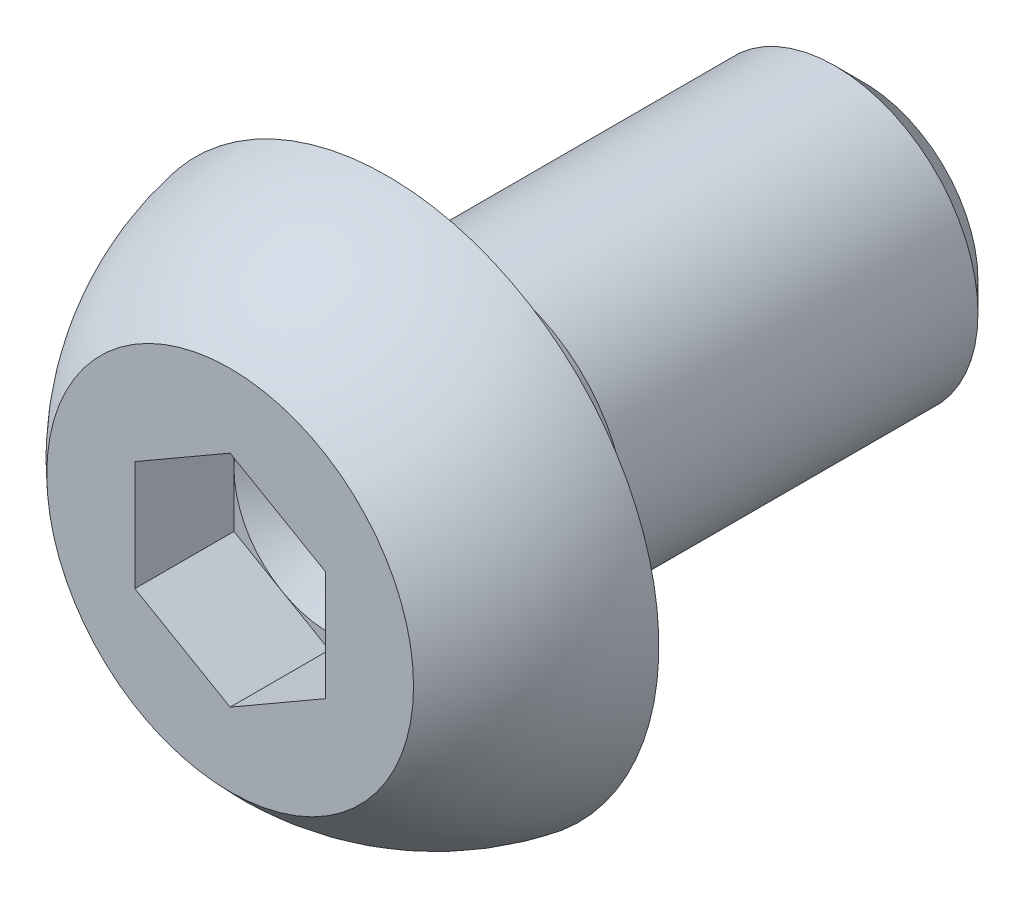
ISO-10303-21;
HEADER;
FILE_DESCRIPTION(('STEP AP214'),'2;1');
FILE_NAME('part.step','',(''),(''),'','','');
FILE_SCHEMA(('AUTOMOTIVE_DESIGN { 1 0 10303 214 1 1 1 1 }'));
ENDSEC;
DATA;
#1=APPLICATION_CONTEXT('core data for automotive mechanical design processes');
#2=APPLICATION_PROTOCOL_DEFINITION('international standard','automotive_design',2000,#1);
#3=PRODUCT_CONTEXT('',#1,'mechanical');
#4=PRODUCT('Part','Part','',(#3));
#5=PRODUCT_RELATED_PRODUCT_CATEGORY('part','',(#4));
#6=PRODUCT_DEFINITION_FORMATION('','',#4);
#7=PRODUCT_DEFINITION_CONTEXT('part definition',#1,'design');
#8=PRODUCT_DEFINITION('design','',#6,#7);
#9=PRODUCT_DEFINITION_SHAPE('','',#8);
#10=(LENGTH_UNIT() NAMED_UNIT(*) SI_UNIT(.MILLI.,.METRE.));
#11=(NAMED_UNIT(*) PLANE_ANGLE_UNIT() SI_UNIT($,.RADIAN.));
#12=(NAMED_UNIT(*) SI_UNIT($,.STERADIAN.) SOLID_ANGLE_UNIT());
#13=UNCERTAINTY_MEASURE_WITH_UNIT(LENGTH_MEASURE(1.E-05),#10,'distance_accuracy_value','');
#14=(GEOMETRIC_REPRESENTATION_CONTEXT(3) GLOBAL_UNCERTAINTY_ASSIGNED_CONTEXT((#13)) GLOBAL_UNIT_ASSIGNED_CONTEXT((#10,
#11,#12)) REPRESENTATION_CONTEXT('',''));
#15=CARTESIAN_POINT('',(0.,0.,0.));
#16=DIRECTION('',(0.,0.,1.));
#17=DIRECTION('',(1.,0.,0.));
#18=AXIS2_PLACEMENT_3D('',#15,#16,#17);
#19=CARTESIAN_POINT('',(0.,0.,-6.));
#20=DIRECTION('',(0.,0.,-1.));
#21=DIRECTION('',(-1.,0.,0.));
#22=AXIS2_PLACEMENT_3D('',#19,#20,#21);
#23=CYLINDRICAL_SURFACE('',#22,1.5);
#24=CARTESIAN_POINT('',(0.,0.,-4.7));
#25=DIRECTION('',(0.,0.,-1.));
#26=DIRECTION('',(-1.,0.,0.));
#27=AXIS2_PLACEMENT_3D('',#24,#25,#26);
#28=CIRCLE('',#27,1.5);
#29=CARTESIAN_POINT('',(-1.49999999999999,0.,-4.7));
#30=VERTEX_POINT('',#29);
#31=EDGE_CURVE('E9',#30,#30,#28,.F.);
#32=ORIENTED_EDGE('',*,*,#31,.T.);
#33=EDGE_LOOP('',(#32));
#34=FACE_BOUND('',#33,.T.);
#35=CARTESIAN_POINT('',(0.,0.,-1.));
#36=DIRECTION('',(0.,0.,-1.));
#37=DIRECTION('',(-1.,0.,0.));
#38=AXIS2_PLACEMENT_3D('',#35,#36,#37);
#39=CIRCLE('',#38,1.5);
#40=CARTESIAN_POINT('',(-1.5,0.,-1.));
#41=VERTEX_POINT('',#40);
#42=EDGE_CURVE('E113',#41,#41,#39,.T.);
#43=ORIENTED_EDGE('',*,*,#42,.T.);
#44=EDGE_LOOP('',(#43));
#45=FACE_BOUND('',#44,.T.);
#46=ADVANCED_FACE('F14',(#34,#45),#23,.T.);
#47=CARTESIAN_POINT('',(0.,1.,1.65));
#48=DIRECTION('',(0.,0.,-1.));
#49=DIRECTION('',(-1.,0.,0.));
#50=AXIS2_PLACEMENT_3D('',#47,#48,#49);
#51=PLANE('',#50);
#52=CARTESIAN_POINT('',(0.,0.,1.65));
#53=DIRECTION('',(0.,0.,-1.));
#54=DIRECTION('',(-1.,0.,0.));
#55=AXIS2_PLACEMENT_3D('',#52,#53,#54);
#56=CIRCLE('',#55,1.925);
#57=CARTESIAN_POINT('',(-1.92499999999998,0.,1.65));
#58=VERTEX_POINT('',#57);
#59=EDGE_CURVE('E128',#58,#58,#56,.T.);
#60=ORIENTED_EDGE('',*,*,#59,.F.);
#61=EDGE_LOOP('',(#60));
#62=FACE_BOUND('',#61,.T.);
#63=DIRECTION('',(0.866025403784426,0.500000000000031,0.));
#64=VECTOR('',#63,1.);
#65=CARTESIAN_POINT('',(0.933012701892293,-0.616025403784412,1.65));
#66=LINE('',#65,#64);
#67=CARTESIAN_POINT('',(0.,-1.15470053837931,1.65));
#68=VERTEX_POINT('',#67);
#69=CARTESIAN_POINT('',(1.00000000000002,-0.577350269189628,1.65));
#70=VERTEX_POINT('',#69);
#71=EDGE_CURVE('E143',#68,#70,#66,.T.);
#72=ORIENTED_EDGE('',*,*,#71,.F.);
#73=DIRECTION('',(0.866025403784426,-0.500000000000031,0.));
#74=VECTOR('',#73,1.);
#75=CARTESIAN_POINT('',(-0.933012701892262,-0.616025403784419,1.65));
#76=LINE('',#75,#74);
#77=CARTESIAN_POINT('',(-0.999999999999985,-0.577350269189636,1.65));
#78=VERTEX_POINT('',#77);
#79=EDGE_CURVE('E140',#78,#68,#76,.T.);
#80=ORIENTED_EDGE('',*,*,#79,.F.);
#81=DIRECTION('',(0.,-1.,0.));
#82=VECTOR('',#81,1.);
#83=CARTESIAN_POINT('',(-0.999999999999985,1.,1.65));
#84=LINE('',#83,#82);
#85=CARTESIAN_POINT('',(-0.999999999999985,0.577350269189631,1.65));
#86=VERTEX_POINT('',#85);
#87=EDGE_CURVE('E136',#86,#78,#84,.T.);
#88=ORIENTED_EDGE('',*,*,#87,.F.);
#89=DIRECTION('',(-0.866025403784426,-0.500000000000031,0.));
#90=VECTOR('',#89,1.);
#91=CARTESIAN_POINT('',(-0.0669872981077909,1.11602540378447,1.65));
#92=LINE('',#91,#90);
#93=CARTESIAN_POINT('',(0.,1.1547005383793,1.65));
#94=VERTEX_POINT('',#93);
#95=EDGE_CURVE('E134',#94,#86,#92,.T.);
#96=ORIENTED_EDGE('',*,*,#95,.F.);
#97=DIRECTION('',(-0.866025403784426,0.500000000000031,0.));
#98=VECTOR('',#97,1.);
#99=CARTESIAN_POINT('',(0.0669872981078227,1.11602540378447,1.65));
#100=LINE('',#99,#98);
#101=CARTESIAN_POINT('',(1.00000000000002,0.577350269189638,1.65));
#102=VERTEX_POINT('',#101);
#103=EDGE_CURVE('E138',#102,#94,#100,.T.);
#104=ORIENTED_EDGE('',*,*,#103,.F.);
#105=DIRECTION('',(0.,1.,0.));
#106=VECTOR('',#105,1.);
#107=CARTESIAN_POINT('',(1.00000000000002,1.,1.65));
#108=LINE('',#107,#106);
#109=EDGE_CURVE('E112',#70,#102,#108,.T.);
#110=ORIENTED_EDGE('',*,*,#109,.F.);
#111=EDGE_LOOP('',(#72,#80,#88,#96,#104,#110));
#112=FACE_BOUND('',#111,.T.);
#113=ADVANCED_FACE('F160',(#62,#112),#51,.F.);
#114=CARTESIAN_POINT('',(0.,0.,-0.489686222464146));
#115=DIRECTION('',(0.,0.,-1.));
#116=DIRECTION('',(-1.,0.,0.));
#117=AXIS2_PLACEMENT_3D('',#114,#115,#116);
#118=DEGENERATE_TOROIDAL_SURFACE('',#117,0.0423840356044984,2.84999999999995,.T.);
#119=ORIENTED_EDGE('',*,*,#59,.T.);
#120=EDGE_LOOP('',(#119));
#121=FACE_BOUND('',#120,.T.);
#122=CARTESIAN_POINT('',(0.,0.,0.));
#123=DIRECTION('',(0.,0.,-1.));
#124=DIRECTION('',(-1.,0.,0.));
#125=AXIS2_PLACEMENT_3D('',#122,#123,#124);
#126=CIRCLE('',#125,2.85);
#127=CARTESIAN_POINT('',(-2.85,0.,0.));
#128=VERTEX_POINT('',#127);
#129=EDGE_CURVE('E125',#128,#128,#126,.T.);
#130=ORIENTED_EDGE('',*,*,#129,.F.);
#131=EDGE_LOOP('',(#130));
#132=FACE_BOUND('',#131,.T.);
#133=ADVANCED_FACE('F167',(#121,#132),#118,.T.);
#134=CARTESIAN_POINT('',(0.,2.85,0.));
#135=DIRECTION('',(0.,0.,1.));
#136=DIRECTION('',(1.,0.,0.));
#137=AXIS2_PLACEMENT_3D('',#134,#135,#136);
#138=PLANE('',#137);
#139=CARTESIAN_POINT('',(0.,0.,0.));
#140=DIRECTION('',(0.,0.,-1.));
#141=DIRECTION('',(-1.,0.,0.));
#142=AXIS2_PLACEMENT_3D('',#139,#140,#141);
#143=CIRCLE('',#142,1.8);
#144=CARTESIAN_POINT('',(-1.8,0.,0.));
#145=VERTEX_POINT('',#144);
#146=EDGE_CURVE('E117',#145,#145,#143,.T.);
#147=ORIENTED_EDGE('',*,*,#146,.F.);
#148=EDGE_LOOP('',(#147));
#149=FACE_BOUND('',#148,.T.);
#150=ORIENTED_EDGE('',*,*,#129,.T.);
#151=EDGE_LOOP('',(#150));
#152=FACE_BOUND('',#151,.T.);
#153=ADVANCED_FACE('F178',(#149,#152),#138,.F.);
#154=CARTESIAN_POINT('',(0.,0.,0.));
#155=DIRECTION('',(0.,0.,1.));
#156=DIRECTION('',(1.,0.,0.));
#157=AXIS2_PLACEMENT_3D('',#154,#155,#156);
#158=CONICAL_SURFACE('',#157,1.8,0.291456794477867);
#159=ORIENTED_EDGE('',*,*,#42,.F.);
#160=EDGE_LOOP('',(#159));
#161=FACE_BOUND('',#160,.T.);
#162=ORIENTED_EDGE('',*,*,#146,.T.);
#163=EDGE_LOOP('',(#162));
#164=FACE_BOUND('',#163,.T.);
#165=ADVANCED_FACE('F174',(#161,#164),#158,.T.);
#166=CARTESIAN_POINT('',(0.,0.,0.61));
#167=DIRECTION('',(0.,0.,-1.));
#168=DIRECTION('',(-1.,0.,0.));
#169=AXIS2_PLACEMENT_3D('',#166,#167,#168);
#170=PLANE('',#169);
#171=DIRECTION('',(0.,1.,0.));
#172=VECTOR('',#171,1.);
#173=CARTESIAN_POINT('',(-0.999999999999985,-0.577350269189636,0.61));
#174=LINE('',#173,#172);
#175=CARTESIAN_POINT('',(-0.999999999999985,-0.577350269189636,0.61));
#176=VERTEX_POINT('',#175);
#177=CARTESIAN_POINT('',(-0.999999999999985,0.,0.61));
#178=VERTEX_POINT('',#177);
#179=EDGE_CURVE('E29',#176,#178,#174,.T.);
#180=ORIENTED_EDGE('',*,*,#179,.F.);
#181=DIRECTION('',(-0.866025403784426,0.500000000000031,0.));
#182=VECTOR('',#181,1.);
#183=CARTESIAN_POINT('',(0.,-1.15470053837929,0.61));
#184=LINE('',#183,#182);
#185=CARTESIAN_POINT('',(-0.500000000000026,-0.866025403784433,0.61));
#186=VERTEX_POINT('',#185);
#187=EDGE_CURVE('E239',#186,#176,#184,.T.);
#188=ORIENTED_EDGE('',*,*,#187,.F.);
#189=CARTESIAN_POINT('',(0.,0.,0.61));
#190=DIRECTION('',(0.,0.,-1.));
#191=DIRECTION('',(-1.,0.,0.));
#192=AXIS2_PLACEMENT_3D('',#189,#190,#191);
#193=CIRCLE('',#192,1.);
#194=EDGE_CURVE('E207',#186,#178,#193,.T.);
#195=ORIENTED_EDGE('',*,*,#194,.T.);
#196=EDGE_LOOP('',(#180,#188,#195));
#197=FACE_BOUND('',#196,.T.);
#198=ADVANCED_FACE('F177',(#197),#170,.F.);
#199=CARTESIAN_POINT('',(0.,-1.15470053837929,0.61));
#200=VERTEX_POINT('',#199);
#201=EDGE_CURVE('E238',#200,#186,#184,.T.);
#202=ORIENTED_EDGE('',*,*,#201,.F.);
#203=DIRECTION('',(-0.866025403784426,-0.500000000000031,0.));
#204=VECTOR('',#203,1.);
#205=CARTESIAN_POINT('',(1.00000000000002,-0.577350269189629,0.61));
#206=LINE('',#205,#204);
#207=CARTESIAN_POINT('',(0.500000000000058,-0.866025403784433,0.61));
#208=VERTEX_POINT('',#207);
#209=EDGE_CURVE('E106',#208,#200,#206,.T.);
#210=ORIENTED_EDGE('',*,*,#209,.F.);
#211=EDGE_CURVE('E247',#208,#186,#193,.T.);
#212=ORIENTED_EDGE('',*,*,#211,.T.);
#213=EDGE_LOOP('',(#202,#210,#212));
#214=FACE_BOUND('',#213,.T.);
#215=ADVANCED_FACE('F249',(#214),#170,.F.);
#216=CARTESIAN_POINT('',(1.00000000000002,-0.577350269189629,0.61));
#217=VERTEX_POINT('',#216);
#218=EDGE_CURVE('E240',#217,#208,#206,.T.);
#219=ORIENTED_EDGE('',*,*,#218,.F.);
#220=DIRECTION('',(0.,-1.,0.));
#221=VECTOR('',#220,1.);
#222=CARTESIAN_POINT('',(1.,0.577350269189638,0.61));
#223=LINE('',#222,#221);
#224=CARTESIAN_POINT('',(1.00000000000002,0.,0.61));
#225=VERTEX_POINT('',#224);
#226=EDGE_CURVE('E107',#225,#217,#223,.T.);
#227=ORIENTED_EDGE('',*,*,#226,.F.);
#228=EDGE_CURVE('E246',#225,#208,#193,.T.);
#229=ORIENTED_EDGE('',*,*,#228,.T.);
#230=EDGE_LOOP('',(#219,#227,#229));
#231=FACE_BOUND('',#230,.T.);
#232=ADVANCED_FACE('F245',(#231),#170,.F.);
#233=CARTESIAN_POINT('',(1.,0.577350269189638,0.61));
#234=VERTEX_POINT('',#233);
#235=EDGE_CURVE('E100',#234,#225,#223,.T.);
#236=ORIENTED_EDGE('',*,*,#235,.F.);
#237=DIRECTION('',(0.866025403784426,-0.500000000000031,0.));
#238=VECTOR('',#237,1.);
#239=CARTESIAN_POINT('',(0.,1.1547005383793,0.61));
#240=LINE('',#239,#238);
#241=CARTESIAN_POINT('',(0.500000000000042,0.86602540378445,0.61));
#242=VERTEX_POINT('',#241);
#243=EDGE_CURVE('E87',#242,#234,#240,.T.);
#244=ORIENTED_EDGE('',*,*,#243,.F.);
#245=EDGE_CURVE('E102',#242,#225,#193,.T.);
#246=ORIENTED_EDGE('',*,*,#245,.T.);
#247=EDGE_LOOP('',(#236,#244,#246));
#248=FACE_BOUND('',#247,.T.);
#249=ADVANCED_FACE('F101',(#248),#170,.F.);
#250=CARTESIAN_POINT('',(0.,1.1547005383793,0.61));
#251=VERTEX_POINT('',#250);
#252=EDGE_CURVE('E95',#251,#242,#240,.T.);
#253=ORIENTED_EDGE('',*,*,#252,.F.);
#254=DIRECTION('',(0.866025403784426,0.500000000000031,0.));
#255=VECTOR('',#254,1.);
#256=CARTESIAN_POINT('',(-1.,0.57735026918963,0.61));
#257=LINE('',#256,#255);
#258=CARTESIAN_POINT('',(-0.500000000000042,0.866025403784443,0.61));
#259=VERTEX_POINT('',#258);
#260=EDGE_CURVE('E208',#259,#251,#257,.T.);
#261=ORIENTED_EDGE('',*,*,#260,.F.);
#262=EDGE_CURVE('E132',#259,#242,#193,.T.);
#263=ORIENTED_EDGE('',*,*,#262,.T.);
#264=EDGE_LOOP('',(#253,#261,#263));
#265=FACE_BOUND('',#264,.T.);
#266=ADVANCED_FACE('F209',(#265),#170,.F.);
#267=CARTESIAN_POINT('',(-1.,0.57735026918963,0.61));
#268=VERTEX_POINT('',#267);
#269=EDGE_CURVE('E204',#268,#259,#257,.T.);
#270=ORIENTED_EDGE('',*,*,#269,.F.);
#271=EDGE_CURVE('E205',#178,#268,#174,.T.);
#272=ORIENTED_EDGE('',*,*,#271,.F.);
#273=EDGE_CURVE('E131',#178,#259,#193,.T.);
#274=ORIENTED_EDGE('',*,*,#273,.T.);
#275=EDGE_LOOP('',(#270,#272,#274));
#276=FACE_BOUND('',#275,.T.);
#277=ADVANCED_FACE('F202',(#276),#170,.F.);
#278=CARTESIAN_POINT('',(0.,1.1547005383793,0.61));
#279=DIRECTION('',(-0.500000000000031,-0.866025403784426,0.));
#280=DIRECTION('',(-0.866025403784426,0.500000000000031,0.));
#281=AXIS2_PLACEMENT_3D('',#278,#279,#280);
#282=PLANE('',#281);
#283=ORIENTED_EDGE('',*,*,#252,.T.);
#284=ORIENTED_EDGE('',*,*,#243,.T.);
#285=DIRECTION('',(0.,0.,1.));
#286=VECTOR('',#285,1.);
#287=CARTESIAN_POINT('',(1.,0.577350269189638,0.61));
#288=LINE('',#287,#286);
#289=EDGE_CURVE('E91',#234,#102,#288,.T.);
#290=ORIENTED_EDGE('',*,*,#289,.T.);
#291=ORIENTED_EDGE('',*,*,#103,.T.);
#292=DIRECTION('',(0.,0.,1.));
#293=VECTOR('',#292,1.);
#294=CARTESIAN_POINT('',(0.,1.1547005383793,0.61));
#295=LINE('',#294,#293);
#296=EDGE_CURVE('E215',#251,#94,#295,.T.);
#297=ORIENTED_EDGE('',*,*,#296,.F.);
#298=EDGE_LOOP('',(#283,#284,#290,#291,#297));
#299=FACE_BOUND('',#298,.T.);
#300=ADVANCED_FACE('F89',(#299),#282,.T.);
#301=CARTESIAN_POINT('',(1.,0.577350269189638,0.61));
#302=DIRECTION('',(-1.,0.,0.));
#303=DIRECTION('',(0.,0.,1.));
#304=AXIS2_PLACEMENT_3D('',#301,#302,#303);
#305=PLANE('',#304);
#306=ORIENTED_EDGE('',*,*,#235,.T.);
#307=ORIENTED_EDGE('',*,*,#226,.T.);
#308=DIRECTION('',(0.,0.,1.));
#309=VECTOR('',#308,1.);
#310=CARTESIAN_POINT('',(1.00000000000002,-0.577350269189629,0.61));
#311=LINE('',#310,#309);
#312=EDGE_CURVE('E114',#217,#70,#311,.T.);
#313=ORIENTED_EDGE('',*,*,#312,.T.);
#314=ORIENTED_EDGE('',*,*,#109,.T.);
#315=ORIENTED_EDGE('',*,*,#289,.F.);
#316=EDGE_LOOP('',(#306,#307,#313,#314,#315));
#317=FACE_BOUND('',#316,.T.);
#318=ADVANCED_FACE('F109',(#317),#305,.T.);
#319=CARTESIAN_POINT('',(1.00000000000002,-0.577350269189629,0.61));
#320=DIRECTION('',(-0.500000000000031,0.866025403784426,0.));
#321=DIRECTION('',(0.866025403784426,0.500000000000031,0.));
#322=AXIS2_PLACEMENT_3D('',#319,#320,#321);
#323=PLANE('',#322);
#324=ORIENTED_EDGE('',*,*,#218,.T.);
#325=ORIENTED_EDGE('',*,*,#209,.T.);
#326=DIRECTION('',(0.,0.,1.));
#327=VECTOR('',#326,1.);
#328=CARTESIAN_POINT('',(0.,-1.15470053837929,0.61));
#329=LINE('',#328,#327);
#330=EDGE_CURVE('E119',#200,#68,#329,.T.);
#331=ORIENTED_EDGE('',*,*,#330,.T.);
#332=ORIENTED_EDGE('',*,*,#71,.T.);
#333=ORIENTED_EDGE('',*,*,#312,.F.);
#334=EDGE_LOOP('',(#324,#325,#331,#332,#333));
#335=FACE_BOUND('',#334,.T.);
#336=ADVANCED_FACE('F228',(#335),#323,.T.);
#337=CARTESIAN_POINT('',(0.,-1.15470053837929,0.61));
#338=DIRECTION('',(0.500000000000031,0.866025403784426,0.));
#339=DIRECTION('',(0.866025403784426,-0.500000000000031,0.));
#340=AXIS2_PLACEMENT_3D('',#337,#338,#339);
#341=PLANE('',#340);
#342=ORIENTED_EDGE('',*,*,#201,.T.);
#343=ORIENTED_EDGE('',*,*,#187,.T.);
#344=DIRECTION('',(0.,0.,1.));
#345=VECTOR('',#344,1.);
#346=CARTESIAN_POINT('',(-0.999999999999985,-0.577350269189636,0.61));
#347=LINE('',#346,#345);
#348=EDGE_CURVE('E221',#176,#78,#347,.T.);
#349=ORIENTED_EDGE('',*,*,#348,.T.);
#350=ORIENTED_EDGE('',*,*,#79,.T.);
#351=ORIENTED_EDGE('',*,*,#330,.F.);
#352=EDGE_LOOP('',(#342,#343,#349,#350,#351));
#353=FACE_BOUND('',#352,.T.);
#354=ADVANCED_FACE('F252',(#353),#341,.T.);
#355=CARTESIAN_POINT('',(-0.999999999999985,-0.577350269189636,0.61));
#356=DIRECTION('',(1.,0.,0.));
#357=DIRECTION('',(0.,0.,-1.));
#358=AXIS2_PLACEMENT_3D('',#355,#356,#357);
#359=PLANE('',#358);
#360=ORIENTED_EDGE('',*,*,#179,.T.);
#361=ORIENTED_EDGE('',*,*,#271,.T.);
#362=DIRECTION('',(0.,0.,1.));
#363=VECTOR('',#362,1.);
#364=CARTESIAN_POINT('',(-1.,0.57735026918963,0.61));
#365=LINE('',#364,#363);
#366=EDGE_CURVE('E214',#268,#86,#365,.T.);
#367=ORIENTED_EDGE('',*,*,#366,.T.);
#368=ORIENTED_EDGE('',*,*,#87,.T.);
#369=ORIENTED_EDGE('',*,*,#348,.F.);
#370=EDGE_LOOP('',(#360,#361,#367,#368,#369));
#371=FACE_BOUND('',#370,.T.);
#372=ADVANCED_FACE('F192',(#371),#359,.T.);
#373=CARTESIAN_POINT('',(-1.,0.57735026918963,0.61));
#374=DIRECTION('',(0.500000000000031,-0.866025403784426,0.));
#375=DIRECTION('',(-0.866025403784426,-0.500000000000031,0.));
#376=AXIS2_PLACEMENT_3D('',#373,#374,#375);
#377=PLANE('',#376);
#378=ORIENTED_EDGE('',*,*,#269,.T.);
#379=ORIENTED_EDGE('',*,*,#260,.T.);
#380=ORIENTED_EDGE('',*,*,#296,.T.);
#381=ORIENTED_EDGE('',*,*,#95,.T.);
#382=ORIENTED_EDGE('',*,*,#366,.F.);
#383=EDGE_LOOP('',(#378,#379,#380,#381,#382));
#384=FACE_BOUND('',#383,.T.);
#385=ADVANCED_FACE('F186',(#384),#377,.T.);
#386=CARTESIAN_POINT('',(0.,0.,0.032649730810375));
#387=DIRECTION('',(0.,0.,1.));
#388=DIRECTION('',(1.,0.,0.));
#389=AXIS2_PLACEMENT_3D('',#386,#387,#388);
#390=CONICAL_SURFACE('',#389,0.,1.0471975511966);
#391=ORIENTED_EDGE('',*,*,#262,.F.);
#392=ORIENTED_EDGE('',*,*,#273,.F.);
#393=ORIENTED_EDGE('',*,*,#194,.F.);
#394=ORIENTED_EDGE('',*,*,#211,.F.);
#395=ORIENTED_EDGE('',*,*,#228,.F.);
#396=ORIENTED_EDGE('',*,*,#245,.F.);
#397=EDGE_LOOP('',(#391,#392,#393,#394,#395,#396));
#398=FACE_BOUND('',#397,.T.);
#399=CARTESIAN_POINT('',(0.,0.,0.0326497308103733));
#400=VERTEX_POINT('',#399);
#401=VERTEX_LOOP('',#400);
#402=FACE_BOUND('',#401,.T.);
#403=ADVANCED_FACE('F156',(#398,#402),#390,.F.);
#404=CARTESIAN_POINT('',(0.,0.,-5.));
#405=DIRECTION('',(0.,0.,-1.));
#406=DIRECTION('',(-1.,0.,0.));
#407=AXIS2_PLACEMENT_3D('',#404,#405,#406);
#408=PLANE('',#407);
#409=CARTESIAN_POINT('',(0.,0.,-5.));
#410=DIRECTION('',(0.,0.,-1.));
#411=DIRECTION('',(-1.,0.,0.));
#412=AXIS2_PLACEMENT_3D('',#409,#410,#411);
#413=CIRCLE('',#412,1.2);
#414=CARTESIAN_POINT('',(-1.19999999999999,0.,-5.));
#415=VERTEX_POINT('',#414);
#416=EDGE_CURVE('E22',#415,#415,#413,.T.);
#417=ORIENTED_EDGE('',*,*,#416,.T.);
#418=EDGE_LOOP('',(#417));
#419=FACE_BOUND('',#418,.T.);
#420=ADVANCED_FACE('F147',(#419),#408,.T.);
#421=CARTESIAN_POINT('',(0.,0.,-5.));
#422=DIRECTION('',(0.,0.,1.));
#423=DIRECTION('',(1.,0.,0.));
#424=AXIS2_PLACEMENT_3D('',#421,#422,#423);
#425=CONICAL_SURFACE('',#424,1.2,0.785398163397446);
#426=ORIENTED_EDGE('',*,*,#31,.F.);
#427=EDGE_LOOP('',(#426));
#428=FACE_BOUND('',#427,.T.);
#429=ORIENTED_EDGE('',*,*,#416,.F.);
#430=EDGE_LOOP('',(#429));
#431=FACE_BOUND('',#430,.T.);
#432=ADVANCED_FACE('F16',(#428,#431),#425,.T.);
#433=CLOSED_SHELL('',(#46,#113,#133,#153,#165,#198,#215,#232,#249,#266,#277,#300,#318,#336,#354,
#372,#385,#403,#420,#432));
#434=MANIFOLD_SOLID_BREP('B1',#433);
#435=ADVANCED_BREP_SHAPE_REPRESENTATION('',(#18,#434),#14);
#436=SHAPE_DEFINITION_REPRESENTATION(#9,#435);
ENDSEC;
END-ISO-10303-21;
